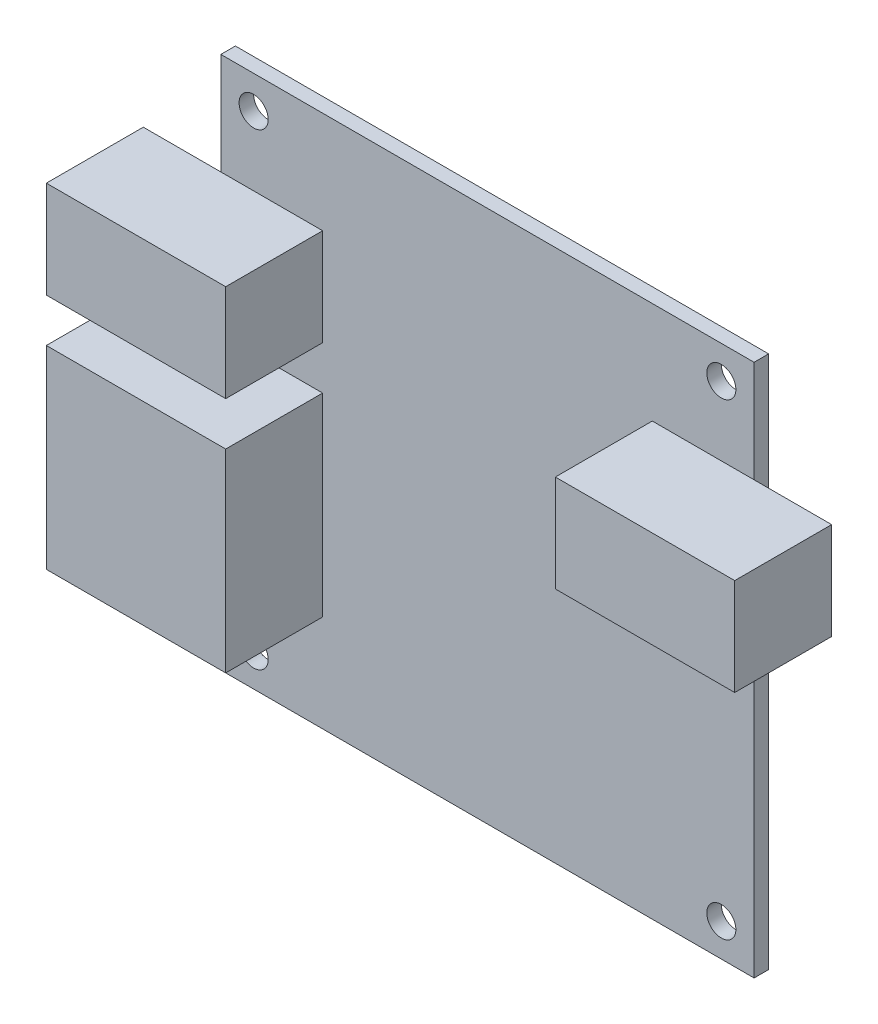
ISO-10303-21;
HEADER;
FILE_DESCRIPTION(('STEP AP214'),'2;1');
FILE_NAME('part.step','',(''),(''),'','','');
FILE_SCHEMA(('AUTOMOTIVE_DESIGN { 1 0 10303 214 1 1 1 1 }'));
ENDSEC;
DATA;
#1=APPLICATION_CONTEXT('core data for automotive mechanical design processes');
#2=APPLICATION_PROTOCOL_DEFINITION('international standard','automotive_design',2000,#1);
#3=PRODUCT_CONTEXT('',#1,'mechanical');
#4=PRODUCT('Part','Part','',(#3));
#5=PRODUCT_RELATED_PRODUCT_CATEGORY('part','',(#4));
#6=PRODUCT_DEFINITION_FORMATION('','',#4);
#7=PRODUCT_DEFINITION_CONTEXT('part definition',#1,'design');
#8=PRODUCT_DEFINITION('design','',#6,#7);
#9=PRODUCT_DEFINITION_SHAPE('','',#8);
#10=(LENGTH_UNIT() NAMED_UNIT(*) SI_UNIT(.MILLI.,.METRE.));
#11=(NAMED_UNIT(*) PLANE_ANGLE_UNIT() SI_UNIT($,.RADIAN.));
#12=(NAMED_UNIT(*) SI_UNIT($,.STERADIAN.) SOLID_ANGLE_UNIT());
#13=UNCERTAINTY_MEASURE_WITH_UNIT(LENGTH_MEASURE(1.E-05),#10,'distance_accuracy_value','');
#14=(GEOMETRIC_REPRESENTATION_CONTEXT(3) GLOBAL_UNCERTAINTY_ASSIGNED_CONTEXT((#13)) GLOBAL_UNIT_ASSIGNED_CONTEXT((#10,
#11,#12)) REPRESENTATION_CONTEXT('',''));
#15=CARTESIAN_POINT('',(0.,0.,0.));
#16=DIRECTION('',(0.,0.,1.));
#17=DIRECTION('',(1.,0.,0.));
#18=AXIS2_PLACEMENT_3D('',#15,#16,#17);
#19=CARTESIAN_POINT('',(0.,0.,1.5));
#20=DIRECTION('',(0.,0.,1.));
#21=DIRECTION('',(1.,0.,0.));
#22=AXIS2_PLACEMENT_3D('',#19,#20,#21);
#23=PLANE('',#22);
#24=CARTESIAN_POINT('',(24.12,24.12,1.5));
#25=DIRECTION('',(0.,0.,1.));
#26=DIRECTION('',(1.,0.,0.));
#27=AXIS2_PLACEMENT_3D('',#24,#25,#26);
#28=CIRCLE('',#27,1.5);
#29=CARTESIAN_POINT('',(25.62,24.12,1.5));
#30=VERTEX_POINT('',#29);
#31=EDGE_CURVE('E256',#30,#30,#28,.T.);
#32=ORIENTED_EDGE('',*,*,#31,.F.);
#33=EDGE_LOOP('',(#32));
#34=FACE_BOUND('',#33,.T.);
#35=CARTESIAN_POINT('',(24.12,-24.12,1.5));
#36=DIRECTION('',(0.,0.,1.));
#37=DIRECTION('',(1.,0.,0.));
#38=AXIS2_PLACEMENT_3D('',#35,#36,#37);
#39=CIRCLE('',#38,1.5);
#40=CARTESIAN_POINT('',(25.62,-24.12,1.5));
#41=VERTEX_POINT('',#40);
#42=EDGE_CURVE('E260',#41,#41,#39,.T.);
#43=ORIENTED_EDGE('',*,*,#42,.F.);
#44=EDGE_LOOP('',(#43));
#45=FACE_BOUND('',#44,.T.);
#46=CARTESIAN_POINT('',(-24.12,-24.12,1.5));
#47=DIRECTION('',(0.,0.,1.));
#48=DIRECTION('',(1.,0.,0.));
#49=AXIS2_PLACEMENT_3D('',#46,#47,#48);
#50=CIRCLE('',#49,1.5);
#51=CARTESIAN_POINT('',(-22.62,-24.12,1.5));
#52=VERTEX_POINT('',#51);
#53=EDGE_CURVE('E266',#52,#52,#50,.T.);
#54=ORIENTED_EDGE('',*,*,#53,.F.);
#55=EDGE_LOOP('',(#54));
#56=FACE_BOUND('',#55,.T.);
#57=CARTESIAN_POINT('',(-24.12,24.12,1.5));
#58=DIRECTION('',(0.,0.,1.));
#59=DIRECTION('',(1.,0.,0.));
#60=AXIS2_PLACEMENT_3D('',#57,#58,#59);
#61=CIRCLE('',#60,1.5);
#62=CARTESIAN_POINT('',(-22.62,24.12,1.5));
#63=VERTEX_POINT('',#62);
#64=EDGE_CURVE('E272',#63,#63,#61,.T.);
#65=ORIENTED_EDGE('',*,*,#64,.F.);
#66=EDGE_LOOP('',(#65));
#67=FACE_BOUND('',#66,.T.);
#68=DIRECTION('',(0.,1.,0.));
#69=VECTOR('',#68,1.);
#70=CARTESIAN_POINT('',(27.5,-27.5,1.5));
#71=LINE('',#70,#69);
#72=CARTESIAN_POINT('',(27.5,-27.5,1.5));
#73=VERTEX_POINT('',#72);
#74=CARTESIAN_POINT('',(27.5,7.00000000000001,1.5));
#75=VERTEX_POINT('',#74);
#76=EDGE_CURVE('E288',#73,#75,#71,.T.);
#77=ORIENTED_EDGE('',*,*,#76,.T.);
#78=DIRECTION('',(1.,0.,0.));
#79=VECTOR('',#78,1.);
#80=CARTESIAN_POINT('',(17.,7.00000000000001,1.5));
#81=LINE('',#80,#79);
#82=CARTESIAN_POINT('',(17.,7.00000000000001,1.5));
#83=VERTEX_POINT('',#82);
#84=EDGE_CURVE('E49',#83,#75,#81,.T.);
#85=ORIENTED_EDGE('',*,*,#84,.F.);
#86=DIRECTION('',(0.,-1.,0.));
#87=VECTOR('',#86,1.);
#88=CARTESIAN_POINT('',(17.,17.,1.5));
#89=LINE('',#88,#87);
#90=CARTESIAN_POINT('',(17.,17.,1.5));
#91=VERTEX_POINT('',#90);
#92=EDGE_CURVE('E54',#91,#83,#89,.T.);
#93=ORIENTED_EDGE('',*,*,#92,.F.);
#94=DIRECTION('',(-1.,0.,0.));
#95=VECTOR('',#94,1.);
#96=CARTESIAN_POINT('',(17.,17.,1.5));
#97=LINE('',#96,#95);
#98=CARTESIAN_POINT('',(27.5,17.,1.5));
#99=VERTEX_POINT('',#98);
#100=EDGE_CURVE('E371',#99,#91,#97,.T.);
#101=ORIENTED_EDGE('',*,*,#100,.F.);
#102=CARTESIAN_POINT('',(27.5,27.5,1.5));
#103=VERTEX_POINT('',#102);
#104=EDGE_CURVE('E287',#99,#103,#71,.T.);
#105=ORIENTED_EDGE('',*,*,#104,.T.);
#106=DIRECTION('',(-1.,0.,0.));
#107=VECTOR('',#106,1.);
#108=CARTESIAN_POINT('',(27.5,27.5,1.5));
#109=LINE('',#108,#107);
#110=CARTESIAN_POINT('',(-27.5,27.5,1.5));
#111=VERTEX_POINT('',#110);
#112=EDGE_CURVE('E290',#103,#111,#109,.T.);
#113=ORIENTED_EDGE('',*,*,#112,.T.);
#114=DIRECTION('',(0.,-1.,0.));
#115=VECTOR('',#114,1.);
#116=CARTESIAN_POINT('',(-27.5,-27.5,1.5));
#117=LINE('',#116,#115);
#118=CARTESIAN_POINT('',(-27.5,17.,1.5));
#119=VERTEX_POINT('',#118);
#120=EDGE_CURVE('E281',#111,#119,#117,.T.);
#121=ORIENTED_EDGE('',*,*,#120,.T.);
#122=DIRECTION('',(-1.,0.,0.));
#123=VECTOR('',#122,1.);
#124=CARTESIAN_POINT('',(-17.,17.,1.5));
#125=LINE('',#124,#123);
#126=CARTESIAN_POINT('',(-17.,17.,1.5));
#127=VERTEX_POINT('',#126);
#128=EDGE_CURVE('E238',#127,#119,#125,.T.);
#129=ORIENTED_EDGE('',*,*,#128,.F.);
#130=DIRECTION('',(0.,1.,0.));
#131=VECTOR('',#130,1.);
#132=CARTESIAN_POINT('',(-17.,17.,1.5));
#133=LINE('',#132,#131);
#134=CARTESIAN_POINT('',(-17.,7.00000000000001,1.5));
#135=VERTEX_POINT('',#134);
#136=EDGE_CURVE('E223',#135,#127,#133,.T.);
#137=ORIENTED_EDGE('',*,*,#136,.F.);
#138=DIRECTION('',(1.,0.,0.));
#139=VECTOR('',#138,1.);
#140=CARTESIAN_POINT('',(-17.,7.00000000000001,1.5));
#141=LINE('',#140,#139);
#142=CARTESIAN_POINT('',(-27.5,7.,1.5));
#143=VERTEX_POINT('',#142);
#144=EDGE_CURVE('E42',#143,#135,#141,.T.);
#145=ORIENTED_EDGE('',*,*,#144,.F.);
#146=CARTESIAN_POINT('',(-27.5,2.5,1.5));
#147=VERTEX_POINT('',#146);
#148=EDGE_CURVE('E340',#143,#147,#117,.T.);
#149=ORIENTED_EDGE('',*,*,#148,.T.);
#150=DIRECTION('',(-1.,0.,0.));
#151=VECTOR('',#150,1.);
#152=CARTESIAN_POINT('',(-17.,2.5,1.5));
#153=LINE('',#152,#151);
#154=CARTESIAN_POINT('',(-17.,2.5,1.5));
#155=VERTEX_POINT('',#154);
#156=EDGE_CURVE('E207',#155,#147,#153,.T.);
#157=ORIENTED_EDGE('',*,*,#156,.F.);
#158=DIRECTION('',(0.,1.,0.));
#159=VECTOR('',#158,1.);
#160=CARTESIAN_POINT('',(-17.,2.5,1.5));
#161=LINE('',#160,#159);
#162=CARTESIAN_POINT('',(-17.,-17.5,1.5));
#163=VERTEX_POINT('',#162);
#164=EDGE_CURVE('E187',#163,#155,#161,.T.);
#165=ORIENTED_EDGE('',*,*,#164,.F.);
#166=DIRECTION('',(-1.,0.,0.));
#167=VECTOR('',#166,1.);
#168=CARTESIAN_POINT('',(0.,-17.5,1.5));
#169=LINE('',#168,#167);
#170=CARTESIAN_POINT('',(-27.5,-17.5,1.5));
#171=VERTEX_POINT('',#170);
#172=EDGE_CURVE('E11',#163,#171,#169,.T.);
#173=ORIENTED_EDGE('',*,*,#172,.T.);
#174=CARTESIAN_POINT('',(-27.5,-27.5,1.5));
#175=VERTEX_POINT('',#174);
#176=EDGE_CURVE('E285',#171,#175,#117,.T.);
#177=ORIENTED_EDGE('',*,*,#176,.T.);
#178=DIRECTION('',(1.,0.,0.));
#179=VECTOR('',#178,1.);
#180=CARTESIAN_POINT('',(27.5,-27.5,1.5));
#181=LINE('',#180,#179);
#182=EDGE_CURVE('E283',#175,#73,#181,.T.);
#183=ORIENTED_EDGE('',*,*,#182,.T.);
#184=EDGE_LOOP('',(#77,#85,#93,#101,#105,#113,#121,#129,#137,#145,#149,#157,#165,#173,#177,#183));
#185=FACE_BOUND('',#184,.T.);
#186=ADVANCED_FACE('F34',(#34,#45,#56,#67,#185),#23,.T.);
#187=CARTESIAN_POINT('',(-27.5,-27.5,1.5));
#188=DIRECTION('',(1.,0.,0.));
#189=DIRECTION('',(0.,0.,-1.));
#190=AXIS2_PLACEMENT_3D('',#187,#188,#189);
#191=PLANE('',#190);
#192=DIRECTION('',(0.,-1.,0.));
#193=VECTOR('',#192,1.);
#194=CARTESIAN_POINT('',(-27.5,-27.5,0.));
#195=LINE('',#194,#193);
#196=CARTESIAN_POINT('',(-27.5,27.5,0.));
#197=VERTEX_POINT('',#196);
#198=CARTESIAN_POINT('',(-27.5,-27.5,0.));
#199=VERTEX_POINT('',#198);
#200=EDGE_CURVE('E278',#197,#199,#195,.T.);
#201=ORIENTED_EDGE('',*,*,#200,.T.);
#202=DIRECTION('',(0.,0.,-1.));
#203=VECTOR('',#202,1.);
#204=CARTESIAN_POINT('',(-27.5,-27.5,1.5));
#205=LINE('',#204,#203);
#206=EDGE_CURVE('E309',#175,#199,#205,.T.);
#207=ORIENTED_EDGE('',*,*,#206,.F.);
#208=ORIENTED_EDGE('',*,*,#176,.F.);
#209=EDGE_CURVE('E341',#147,#171,#117,.T.);
#210=ORIENTED_EDGE('',*,*,#209,.F.);
#211=ORIENTED_EDGE('',*,*,#148,.F.);
#212=EDGE_CURVE('E284',#119,#143,#117,.T.);
#213=ORIENTED_EDGE('',*,*,#212,.F.);
#214=ORIENTED_EDGE('',*,*,#120,.F.);
#215=DIRECTION('',(0.,0.,-1.));
#216=VECTOR('',#215,1.);
#217=CARTESIAN_POINT('',(-27.5,27.5,1.5));
#218=LINE('',#217,#216);
#219=EDGE_CURVE('E293',#111,#197,#218,.T.);
#220=ORIENTED_EDGE('',*,*,#219,.T.);
#221=EDGE_LOOP('',(#201,#207,#208,#210,#211,#213,#214,#220));
#222=FACE_BOUND('',#221,.T.);
#223=ADVANCED_FACE('F36',(#222),#191,.F.);
#224=CARTESIAN_POINT('',(27.5,-27.5,1.5));
#225=DIRECTION('',(0.,1.,0.));
#226=DIRECTION('',(-1.,0.,0.));
#227=AXIS2_PLACEMENT_3D('',#224,#225,#226);
#228=PLANE('',#227);
#229=DIRECTION('',(1.,0.,0.));
#230=VECTOR('',#229,1.);
#231=CARTESIAN_POINT('',(27.5,-27.5,0.));
#232=LINE('',#231,#230);
#233=CARTESIAN_POINT('',(27.5,-27.5,0.));
#234=VERTEX_POINT('',#233);
#235=EDGE_CURVE('E296',#199,#234,#232,.T.);
#236=ORIENTED_EDGE('',*,*,#235,.T.);
#237=DIRECTION('',(0.,0.,-1.));
#238=VECTOR('',#237,1.);
#239=CARTESIAN_POINT('',(27.5,-27.5,1.5));
#240=LINE('',#239,#238);
#241=EDGE_CURVE('E307',#73,#234,#240,.T.);
#242=ORIENTED_EDGE('',*,*,#241,.F.);
#243=ORIENTED_EDGE('',*,*,#182,.F.);
#244=ORIENTED_EDGE('',*,*,#206,.T.);
#245=EDGE_LOOP('',(#236,#242,#243,#244));
#246=FACE_BOUND('',#245,.T.);
#247=ADVANCED_FACE('F350',(#246),#228,.F.);
#248=CARTESIAN_POINT('',(27.5,-27.5,1.5));
#249=DIRECTION('',(-1.,0.,0.));
#250=DIRECTION('',(0.,0.,1.));
#251=AXIS2_PLACEMENT_3D('',#248,#249,#250);
#252=PLANE('',#251);
#253=DIRECTION('',(0.,1.,0.));
#254=VECTOR('',#253,1.);
#255=CARTESIAN_POINT('',(27.5,-27.5,0.));
#256=LINE('',#255,#254);
#257=CARTESIAN_POINT('',(27.5,27.5,0.));
#258=VERTEX_POINT('',#257);
#259=EDGE_CURVE('E298',#234,#258,#256,.T.);
#260=ORIENTED_EDGE('',*,*,#259,.T.);
#261=DIRECTION('',(0.,0.,-1.));
#262=VECTOR('',#261,1.);
#263=CARTESIAN_POINT('',(27.5,27.5,1.5));
#264=LINE('',#263,#262);
#265=EDGE_CURVE('E304',#103,#258,#264,.T.);
#266=ORIENTED_EDGE('',*,*,#265,.F.);
#267=ORIENTED_EDGE('',*,*,#104,.F.);
#268=EDGE_CURVE('E291',#75,#99,#71,.T.);
#269=ORIENTED_EDGE('',*,*,#268,.F.);
#270=ORIENTED_EDGE('',*,*,#76,.F.);
#271=ORIENTED_EDGE('',*,*,#241,.T.);
#272=EDGE_LOOP('',(#260,#266,#267,#269,#270,#271));
#273=FACE_BOUND('',#272,.T.);
#274=ADVANCED_FACE('F359',(#273),#252,.F.);
#275=CARTESIAN_POINT('',(27.5,27.5,1.5));
#276=DIRECTION('',(0.,-1.,0.));
#277=DIRECTION('',(1.,0.,0.));
#278=AXIS2_PLACEMENT_3D('',#275,#276,#277);
#279=PLANE('',#278);
#280=DIRECTION('',(-1.,0.,0.));
#281=VECTOR('',#280,1.);
#282=CARTESIAN_POINT('',(27.5,27.5,0.));
#283=LINE('',#282,#281);
#284=EDGE_CURVE('E300',#258,#197,#283,.T.);
#285=ORIENTED_EDGE('',*,*,#284,.T.);
#286=ORIENTED_EDGE('',*,*,#219,.F.);
#287=ORIENTED_EDGE('',*,*,#112,.F.);
#288=ORIENTED_EDGE('',*,*,#265,.T.);
#289=EDGE_LOOP('',(#285,#286,#287,#288));
#290=FACE_BOUND('',#289,.T.);
#291=ADVANCED_FACE('F407',(#290),#279,.F.);
#292=CARTESIAN_POINT('',(0.,0.,0.));
#293=DIRECTION('',(0.,0.,1.));
#294=DIRECTION('',(1.,0.,0.));
#295=AXIS2_PLACEMENT_3D('',#292,#293,#294);
#296=PLANE('',#295);
#297=CARTESIAN_POINT('',(24.12,24.12,0.));
#298=DIRECTION('',(0.,0.,1.));
#299=DIRECTION('',(1.,0.,0.));
#300=AXIS2_PLACEMENT_3D('',#297,#298,#299);
#301=CIRCLE('',#300,1.5);
#302=CARTESIAN_POINT('',(25.62,24.12,0.));
#303=VERTEX_POINT('',#302);
#304=EDGE_CURVE('E257',#303,#303,#301,.T.);
#305=ORIENTED_EDGE('',*,*,#304,.T.);
#306=EDGE_LOOP('',(#305));
#307=FACE_BOUND('',#306,.T.);
#308=CARTESIAN_POINT('',(24.12,-24.12,0.));
#309=DIRECTION('',(0.,0.,1.));
#310=DIRECTION('',(1.,0.,0.));
#311=AXIS2_PLACEMENT_3D('',#308,#309,#310);
#312=CIRCLE('',#311,1.5);
#313=CARTESIAN_POINT('',(25.62,-24.12,0.));
#314=VERTEX_POINT('',#313);
#315=EDGE_CURVE('E263',#314,#314,#312,.T.);
#316=ORIENTED_EDGE('',*,*,#315,.T.);
#317=EDGE_LOOP('',(#316));
#318=FACE_BOUND('',#317,.T.);
#319=CARTESIAN_POINT('',(-24.12,-24.12,0.));
#320=DIRECTION('',(0.,0.,1.));
#321=DIRECTION('',(1.,0.,0.));
#322=AXIS2_PLACEMENT_3D('',#319,#320,#321);
#323=CIRCLE('',#322,1.5);
#324=CARTESIAN_POINT('',(-22.62,-24.12,0.));
#325=VERTEX_POINT('',#324);
#326=EDGE_CURVE('E269',#325,#325,#323,.T.);
#327=ORIENTED_EDGE('',*,*,#326,.T.);
#328=EDGE_LOOP('',(#327));
#329=FACE_BOUND('',#328,.T.);
#330=CARTESIAN_POINT('',(-24.12,24.12,0.));
#331=DIRECTION('',(0.,0.,1.));
#332=DIRECTION('',(1.,0.,0.));
#333=AXIS2_PLACEMENT_3D('',#330,#331,#332);
#334=CIRCLE('',#333,1.5);
#335=CARTESIAN_POINT('',(-22.62,24.12,0.));
#336=VERTEX_POINT('',#335);
#337=EDGE_CURVE('E275',#336,#336,#334,.T.);
#338=ORIENTED_EDGE('',*,*,#337,.T.);
#339=EDGE_LOOP('',(#338));
#340=FACE_BOUND('',#339,.T.);
#341=ORIENTED_EDGE('',*,*,#200,.F.);
#342=ORIENTED_EDGE('',*,*,#284,.F.);
#343=ORIENTED_EDGE('',*,*,#259,.F.);
#344=ORIENTED_EDGE('',*,*,#235,.F.);
#345=EDGE_LOOP('',(#341,#342,#343,#344));
#346=FACE_BOUND('',#345,.T.);
#347=ADVANCED_FACE('F356',(#307,#318,#329,#340,#346),#296,.F.);
#348=CARTESIAN_POINT('',(-24.12,24.12,0.));
#349=DIRECTION('',(0.,0.,1.));
#350=DIRECTION('',(1.,0.,0.));
#351=AXIS2_PLACEMENT_3D('',#348,#349,#350);
#352=CYLINDRICAL_SURFACE('',#351,1.5);
#353=ORIENTED_EDGE('',*,*,#337,.F.);
#354=EDGE_LOOP('',(#353));
#355=FACE_BOUND('',#354,.T.);
#356=ORIENTED_EDGE('',*,*,#64,.T.);
#357=EDGE_LOOP('',(#356));
#358=FACE_BOUND('',#357,.T.);
#359=ADVANCED_FACE('F403',(#355,#358),#352,.F.);
#360=CARTESIAN_POINT('',(-24.12,-24.12,0.));
#361=DIRECTION('',(0.,0.,1.));
#362=DIRECTION('',(1.,0.,0.));
#363=AXIS2_PLACEMENT_3D('',#360,#361,#362);
#364=CYLINDRICAL_SURFACE('',#363,1.5);
#365=ORIENTED_EDGE('',*,*,#326,.F.);
#366=EDGE_LOOP('',(#365));
#367=FACE_BOUND('',#366,.T.);
#368=ORIENTED_EDGE('',*,*,#53,.T.);
#369=EDGE_LOOP('',(#368));
#370=FACE_BOUND('',#369,.T.);
#371=ADVANCED_FACE('F437',(#367,#370),#364,.F.);
#372=CARTESIAN_POINT('',(24.12,-24.12,0.));
#373=DIRECTION('',(0.,0.,1.));
#374=DIRECTION('',(1.,0.,0.));
#375=AXIS2_PLACEMENT_3D('',#372,#373,#374);
#376=CYLINDRICAL_SURFACE('',#375,1.5);
#377=ORIENTED_EDGE('',*,*,#315,.F.);
#378=EDGE_LOOP('',(#377));
#379=FACE_BOUND('',#378,.T.);
#380=ORIENTED_EDGE('',*,*,#42,.T.);
#381=EDGE_LOOP('',(#380));
#382=FACE_BOUND('',#381,.T.);
#383=ADVANCED_FACE('F444',(#379,#382),#376,.F.);
#384=CARTESIAN_POINT('',(24.12,24.12,0.));
#385=DIRECTION('',(0.,0.,1.));
#386=DIRECTION('',(1.,0.,0.));
#387=AXIS2_PLACEMENT_3D('',#384,#385,#386);
#388=CYLINDRICAL_SURFACE('',#387,1.5);
#389=ORIENTED_EDGE('',*,*,#304,.F.);
#390=EDGE_LOOP('',(#389));
#391=FACE_BOUND('',#390,.T.);
#392=ORIENTED_EDGE('',*,*,#31,.T.);
#393=EDGE_LOOP('',(#392));
#394=FACE_BOUND('',#393,.T.);
#395=ADVANCED_FACE('F451',(#391,#394),#388,.F.);
#396=CARTESIAN_POINT('',(-17.,17.,11.5));
#397=DIRECTION('',(-1.,0.,0.));
#398=DIRECTION('',(0.,0.,1.));
#399=AXIS2_PLACEMENT_3D('',#396,#397,#398);
#400=PLANE('',#399);
#401=ORIENTED_EDGE('',*,*,#136,.T.);
#402=DIRECTION('',(0.,0.,-1.));
#403=VECTOR('',#402,1.);
#404=CARTESIAN_POINT('',(-17.,17.,11.5));
#405=LINE('',#404,#403);
#406=CARTESIAN_POINT('',(-17.,17.,11.5));
#407=VERTEX_POINT('',#406);
#408=EDGE_CURVE('E253',#407,#127,#405,.T.);
#409=ORIENTED_EDGE('',*,*,#408,.F.);
#410=DIRECTION('',(0.,1.,0.));
#411=VECTOR('',#410,1.);
#412=CARTESIAN_POINT('',(-17.,17.,11.5));
#413=LINE('',#412,#411);
#414=CARTESIAN_POINT('',(-17.,7.00000000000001,11.5));
#415=VERTEX_POINT('',#414);
#416=EDGE_CURVE('E224',#415,#407,#413,.T.);
#417=ORIENTED_EDGE('',*,*,#416,.F.);
#418=DIRECTION('',(0.,0.,-1.));
#419=VECTOR('',#418,1.);
#420=CARTESIAN_POINT('',(-17.,7.00000000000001,11.5));
#421=LINE('',#420,#419);
#422=EDGE_CURVE('E234',#415,#135,#421,.T.);
#423=ORIENTED_EDGE('',*,*,#422,.T.);
#424=EDGE_LOOP('',(#401,#409,#417,#423));
#425=FACE_BOUND('',#424,.T.);
#426=ADVANCED_FACE('F324',(#425),#400,.F.);
#427=CARTESIAN_POINT('',(-17.,17.,11.5));
#428=DIRECTION('',(0.,-1.,0.));
#429=DIRECTION('',(1.,0.,0.));
#430=AXIS2_PLACEMENT_3D('',#427,#428,#429);
#431=PLANE('',#430);
#432=ORIENTED_EDGE('',*,*,#128,.T.);
#433=CARTESIAN_POINT('',(-35.5,17.,1.5));
#434=VERTEX_POINT('',#433);
#435=EDGE_CURVE('E237',#119,#434,#125,.T.);
#436=ORIENTED_EDGE('',*,*,#435,.T.);
#437=DIRECTION('',(0.,0.,-1.));
#438=VECTOR('',#437,1.);
#439=CARTESIAN_POINT('',(-35.5,17.,11.5));
#440=LINE('',#439,#438);
#441=CARTESIAN_POINT('',(-35.5,17.,11.5));
#442=VERTEX_POINT('',#441);
#443=EDGE_CURVE('E250',#442,#434,#440,.T.);
#444=ORIENTED_EDGE('',*,*,#443,.F.);
#445=DIRECTION('',(-1.,0.,0.));
#446=VECTOR('',#445,1.);
#447=CARTESIAN_POINT('',(-17.,17.,11.5));
#448=LINE('',#447,#446);
#449=EDGE_CURVE('E227',#407,#442,#448,.T.);
#450=ORIENTED_EDGE('',*,*,#449,.F.);
#451=ORIENTED_EDGE('',*,*,#408,.T.);
#452=EDGE_LOOP('',(#432,#436,#444,#450,#451));
#453=FACE_BOUND('',#452,.T.);
#454=ADVANCED_FACE('F466',(#453),#431,.F.);
#455=CARTESIAN_POINT('',(-35.5,17.,11.5));
#456=DIRECTION('',(1.,0.,0.));
#457=DIRECTION('',(0.,0.,-1.));
#458=AXIS2_PLACEMENT_3D('',#455,#456,#457);
#459=PLANE('',#458);
#460=DIRECTION('',(0.,-1.,0.));
#461=VECTOR('',#460,1.);
#462=CARTESIAN_POINT('',(-35.5,17.,1.5));
#463=LINE('',#462,#461);
#464=CARTESIAN_POINT('',(-35.5,7.,1.5));
#465=VERTEX_POINT('',#464);
#466=EDGE_CURVE('E241',#434,#465,#463,.T.);
#467=ORIENTED_EDGE('',*,*,#466,.T.);
#468=DIRECTION('',(0.,0.,-1.));
#469=VECTOR('',#468,1.);
#470=CARTESIAN_POINT('',(-35.5,7.,11.5));
#471=LINE('',#470,#469);
#472=CARTESIAN_POINT('',(-35.5,7.,11.5));
#473=VERTEX_POINT('',#472);
#474=EDGE_CURVE('E247',#473,#465,#471,.T.);
#475=ORIENTED_EDGE('',*,*,#474,.F.);
#476=DIRECTION('',(0.,-1.,0.));
#477=VECTOR('',#476,1.);
#478=CARTESIAN_POINT('',(-35.5,17.,11.5));
#479=LINE('',#478,#477);
#480=EDGE_CURVE('E230',#442,#473,#479,.T.);
#481=ORIENTED_EDGE('',*,*,#480,.F.);
#482=ORIENTED_EDGE('',*,*,#443,.T.);
#483=EDGE_LOOP('',(#467,#475,#481,#482));
#484=FACE_BOUND('',#483,.T.);
#485=ADVANCED_FACE('F474',(#484),#459,.F.);
#486=CARTESIAN_POINT('',(-17.,7.00000000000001,11.5));
#487=DIRECTION('',(0.,1.,0.));
#488=DIRECTION('',(-1.,0.,0.));
#489=AXIS2_PLACEMENT_3D('',#486,#487,#488);
#490=PLANE('',#489);
#491=EDGE_CURVE('E228',#465,#143,#141,.T.);
#492=ORIENTED_EDGE('',*,*,#491,.T.);
#493=ORIENTED_EDGE('',*,*,#144,.T.);
#494=ORIENTED_EDGE('',*,*,#422,.F.);
#495=DIRECTION('',(1.,0.,0.));
#496=VECTOR('',#495,1.);
#497=CARTESIAN_POINT('',(-17.,7.00000000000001,11.5));
#498=LINE('',#497,#496);
#499=EDGE_CURVE('E232',#473,#415,#498,.T.);
#500=ORIENTED_EDGE('',*,*,#499,.F.);
#501=ORIENTED_EDGE('',*,*,#474,.T.);
#502=EDGE_LOOP('',(#492,#493,#494,#500,#501));
#503=FACE_BOUND('',#502,.T.);
#504=ADVANCED_FACE('F317',(#503),#490,.F.);
#505=CARTESIAN_POINT('',(0.,0.,11.5));
#506=DIRECTION('',(0.,0.,-1.));
#507=DIRECTION('',(-1.,0.,0.));
#508=AXIS2_PLACEMENT_3D('',#505,#506,#507);
#509=PLANE('',#508);
#510=ORIENTED_EDGE('',*,*,#416,.T.);
#511=ORIENTED_EDGE('',*,*,#449,.T.);
#512=ORIENTED_EDGE('',*,*,#480,.T.);
#513=ORIENTED_EDGE('',*,*,#499,.T.);
#514=EDGE_LOOP('',(#510,#511,#512,#513));
#515=FACE_BOUND('',#514,.T.);
#516=ADVANCED_FACE('F327',(#515),#509,.F.);
#517=CARTESIAN_POINT('',(0.,0.,1.5));
#518=DIRECTION('',(0.,0.,-1.));
#519=DIRECTION('',(-1.,0.,0.));
#520=AXIS2_PLACEMENT_3D('',#517,#518,#519);
#521=PLANE('',#520);
#522=ORIENTED_EDGE('',*,*,#435,.F.);
#523=ORIENTED_EDGE('',*,*,#212,.T.);
#524=ORIENTED_EDGE('',*,*,#491,.F.);
#525=ORIENTED_EDGE('',*,*,#466,.F.);
#526=EDGE_LOOP('',(#522,#523,#524,#525));
#527=FACE_BOUND('',#526,.T.);
#528=ADVANCED_FACE('F336',(#527),#521,.T.);
#529=CARTESIAN_POINT('',(0.,0.,1.5));
#530=DIRECTION('',(0.,0.,-1.));
#531=DIRECTION('',(-1.,0.,0.));
#532=AXIS2_PLACEMENT_3D('',#529,#530,#531);
#533=PLANE('',#532);
#534=ORIENTED_EDGE('',*,*,#209,.T.);
#535=DIRECTION('',(1.,0.,0.));
#536=VECTOR('',#535,1.);
#537=CARTESIAN_POINT('',(-17.,-17.5,1.5));
#538=LINE('',#537,#536);
#539=CARTESIAN_POINT('',(-35.5,-17.5,1.5));
#540=VERTEX_POINT('',#539);
#541=EDGE_CURVE('E200',#540,#171,#538,.T.);
#542=ORIENTED_EDGE('',*,*,#541,.F.);
#543=DIRECTION('',(0.,-1.,0.));
#544=VECTOR('',#543,1.);
#545=CARTESIAN_POINT('',(-35.5,2.5,1.5));
#546=LINE('',#545,#544);
#547=CARTESIAN_POINT('',(-35.5,2.5,1.5));
#548=VERTEX_POINT('',#547);
#549=EDGE_CURVE('E210',#548,#540,#546,.T.);
#550=ORIENTED_EDGE('',*,*,#549,.F.);
#551=EDGE_CURVE('E190',#147,#548,#153,.T.);
#552=ORIENTED_EDGE('',*,*,#551,.F.);
#553=EDGE_LOOP('',(#534,#542,#550,#552));
#554=FACE_BOUND('',#553,.T.);
#555=ADVANCED_FACE('F502',(#554),#533,.T.);
#556=CARTESIAN_POINT('',(-17.,2.5,11.5));
#557=DIRECTION('',(-1.,0.,0.));
#558=DIRECTION('',(0.,-1.,0.));
#559=AXIS2_PLACEMENT_3D('',#556,#557,#558);
#560=PLANE('',#559);
#561=ORIENTED_EDGE('',*,*,#164,.T.);
#562=DIRECTION('',(0.,0.,-1.));
#563=VECTOR('',#562,1.);
#564=CARTESIAN_POINT('',(-17.,2.5,11.5));
#565=LINE('',#564,#563);
#566=CARTESIAN_POINT('',(-17.,2.5,11.5));
#567=VERTEX_POINT('',#566);
#568=EDGE_CURVE('E221',#567,#155,#565,.T.);
#569=ORIENTED_EDGE('',*,*,#568,.F.);
#570=DIRECTION('',(0.,1.,0.));
#571=VECTOR('',#570,1.);
#572=CARTESIAN_POINT('',(-17.,2.5,11.5));
#573=LINE('',#572,#571);
#574=CARTESIAN_POINT('',(-17.,-17.5,11.5));
#575=VERTEX_POINT('',#574);
#576=EDGE_CURVE('E196',#575,#567,#573,.T.);
#577=ORIENTED_EDGE('',*,*,#576,.F.);
#578=DIRECTION('',(0.,0.,-1.));
#579=VECTOR('',#578,1.);
#580=CARTESIAN_POINT('',(-17.,-17.5,11.5));
#581=LINE('',#580,#579);
#582=EDGE_CURVE('E205',#575,#163,#581,.T.);
#583=ORIENTED_EDGE('',*,*,#582,.T.);
#584=EDGE_LOOP('',(#561,#569,#577,#583));
#585=FACE_BOUND('',#584,.T.);
#586=ADVANCED_FACE('F509',(#585),#560,.F.);
#587=CARTESIAN_POINT('',(-17.,2.5,11.5));
#588=DIRECTION('',(0.,-1.,0.));
#589=DIRECTION('',(1.,0.,0.));
#590=AXIS2_PLACEMENT_3D('',#587,#588,#589);
#591=PLANE('',#590);
#592=ORIENTED_EDGE('',*,*,#156,.T.);
#593=ORIENTED_EDGE('',*,*,#551,.T.);
#594=DIRECTION('',(0.,0.,-1.));
#595=VECTOR('',#594,1.);
#596=CARTESIAN_POINT('',(-35.5,2.5,11.5));
#597=LINE('',#596,#595);
#598=CARTESIAN_POINT('',(-35.5,2.5,11.5));
#599=VERTEX_POINT('',#598);
#600=EDGE_CURVE('E218',#599,#548,#597,.T.);
#601=ORIENTED_EDGE('',*,*,#600,.F.);
#602=DIRECTION('',(-1.,0.,0.));
#603=VECTOR('',#602,1.);
#604=CARTESIAN_POINT('',(-17.,2.5,11.5));
#605=LINE('',#604,#603);
#606=EDGE_CURVE('E199',#567,#599,#605,.T.);
#607=ORIENTED_EDGE('',*,*,#606,.F.);
#608=ORIENTED_EDGE('',*,*,#568,.T.);
#609=EDGE_LOOP('',(#592,#593,#601,#607,#608));
#610=FACE_BOUND('',#609,.T.);
#611=ADVANCED_FACE('F517',(#610),#591,.F.);
#612=CARTESIAN_POINT('',(-35.5,2.5,11.5));
#613=DIRECTION('',(1.,0.,0.));
#614=DIRECTION('',(0.,0.,-1.));
#615=AXIS2_PLACEMENT_3D('',#612,#613,#614);
#616=PLANE('',#615);
#617=ORIENTED_EDGE('',*,*,#549,.T.);
#618=DIRECTION('',(0.,0.,-1.));
#619=VECTOR('',#618,1.);
#620=CARTESIAN_POINT('',(-35.5,-17.5,11.5));
#621=LINE('',#620,#619);
#622=CARTESIAN_POINT('',(-35.5,-17.5,11.5));
#623=VERTEX_POINT('',#622);
#624=EDGE_CURVE('E215',#623,#540,#621,.T.);
#625=ORIENTED_EDGE('',*,*,#624,.F.);
#626=DIRECTION('',(0.,-1.,0.));
#627=VECTOR('',#626,1.);
#628=CARTESIAN_POINT('',(-35.5,2.5,11.5));
#629=LINE('',#628,#627);
#630=EDGE_CURVE('E202',#599,#623,#629,.T.);
#631=ORIENTED_EDGE('',*,*,#630,.F.);
#632=ORIENTED_EDGE('',*,*,#600,.T.);
#633=EDGE_LOOP('',(#617,#625,#631,#632));
#634=FACE_BOUND('',#633,.T.);
#635=ADVANCED_FACE('F525',(#634),#616,.F.);
#636=CARTESIAN_POINT('',(-17.,-17.5,11.5));
#637=DIRECTION('',(0.,1.,0.));
#638=DIRECTION('',(-1.,0.,0.));
#639=AXIS2_PLACEMENT_3D('',#636,#637,#638);
#640=PLANE('',#639);
#641=ORIENTED_EDGE('',*,*,#541,.T.);
#642=ORIENTED_EDGE('',*,*,#172,.F.);
#643=ORIENTED_EDGE('',*,*,#582,.F.);
#644=DIRECTION('',(1.,0.,0.));
#645=VECTOR('',#644,1.);
#646=CARTESIAN_POINT('',(-17.,-17.5,11.5));
#647=LINE('',#646,#645);
#648=EDGE_CURVE('E204',#623,#575,#647,.T.);
#649=ORIENTED_EDGE('',*,*,#648,.F.);
#650=ORIENTED_EDGE('',*,*,#624,.T.);
#651=EDGE_LOOP('',(#641,#642,#643,#649,#650));
#652=FACE_BOUND('',#651,.T.);
#653=ADVANCED_FACE('F533',(#652),#640,.F.);
#654=CARTESIAN_POINT('',(0.,0.,11.5));
#655=DIRECTION('',(0.,0.,-1.));
#656=DIRECTION('',(-1.,0.,0.));
#657=AXIS2_PLACEMENT_3D('',#654,#655,#656);
#658=PLANE('',#657);
#659=ORIENTED_EDGE('',*,*,#576,.T.);
#660=ORIENTED_EDGE('',*,*,#606,.T.);
#661=ORIENTED_EDGE('',*,*,#630,.T.);
#662=ORIENTED_EDGE('',*,*,#648,.T.);
#663=EDGE_LOOP('',(#659,#660,#661,#662));
#664=FACE_BOUND('',#663,.T.);
#665=ADVANCED_FACE('F540',(#664),#658,.F.);
#666=CARTESIAN_POINT('',(0.,0.,1.5));
#667=DIRECTION('',(0.,0.,1.));
#668=DIRECTION('',(1.,0.,0.));
#669=AXIS2_PLACEMENT_3D('',#666,#667,#668);
#670=PLANE('',#669);
#671=CARTESIAN_POINT('',(35.5,7.00000000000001,1.5));
#672=VERTEX_POINT('',#671);
#673=EDGE_CURVE('E365',#75,#672,#81,.T.);
#674=ORIENTED_EDGE('',*,*,#673,.F.);
#675=ORIENTED_EDGE('',*,*,#268,.T.);
#676=CARTESIAN_POINT('',(35.5,17.,1.5));
#677=VERTEX_POINT('',#676);
#678=EDGE_CURVE('E184',#677,#99,#97,.T.);
#679=ORIENTED_EDGE('',*,*,#678,.F.);
#680=DIRECTION('',(0.,1.,0.));
#681=VECTOR('',#680,1.);
#682=CARTESIAN_POINT('',(35.5,17.,1.5));
#683=LINE('',#682,#681);
#684=EDGE_CURVE('E369',#672,#677,#683,.T.);
#685=ORIENTED_EDGE('',*,*,#684,.F.);
#686=EDGE_LOOP('',(#674,#675,#679,#685));
#687=FACE_BOUND('',#686,.T.);
#688=ADVANCED_FACE('F366',(#687),#670,.F.);
#689=CARTESIAN_POINT('',(17.,17.,11.5));
#690=DIRECTION('',(1.,0.,0.));
#691=DIRECTION('',(0.,1.,0.));
#692=AXIS2_PLACEMENT_3D('',#689,#690,#691);
#693=PLANE('',#692);
#694=ORIENTED_EDGE('',*,*,#92,.T.);
#695=DIRECTION('',(0.,0.,-1.));
#696=VECTOR('',#695,1.);
#697=CARTESIAN_POINT('',(17.,7.00000000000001,11.5));
#698=LINE('',#697,#696);
#699=CARTESIAN_POINT('',(17.,7.00000000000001,11.5));
#700=VERTEX_POINT('',#699);
#701=EDGE_CURVE('E169',#700,#83,#698,.T.);
#702=ORIENTED_EDGE('',*,*,#701,.F.);
#703=DIRECTION('',(0.,-1.,0.));
#704=VECTOR('',#703,1.);
#705=CARTESIAN_POINT('',(17.,17.,11.5));
#706=LINE('',#705,#704);
#707=CARTESIAN_POINT('',(17.,17.,11.5));
#708=VERTEX_POINT('',#707);
#709=EDGE_CURVE('E175',#708,#700,#706,.T.);
#710=ORIENTED_EDGE('',*,*,#709,.F.);
#711=DIRECTION('',(0.,0.,-1.));
#712=VECTOR('',#711,1.);
#713=CARTESIAN_POINT('',(17.,17.,11.5));
#714=LINE('',#713,#712);
#715=EDGE_CURVE('E377',#708,#91,#714,.T.);
#716=ORIENTED_EDGE('',*,*,#715,.T.);
#717=EDGE_LOOP('',(#694,#702,#710,#716));
#718=FACE_BOUND('',#717,.T.);
#719=ADVANCED_FACE('F186',(#718),#693,.F.);
#720=CARTESIAN_POINT('',(17.,7.00000000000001,11.5));
#721=DIRECTION('',(0.,1.,0.));
#722=DIRECTION('',(0.,0.,1.));
#723=AXIS2_PLACEMENT_3D('',#720,#721,#722);
#724=PLANE('',#723);
#725=ORIENTED_EDGE('',*,*,#84,.T.);
#726=ORIENTED_EDGE('',*,*,#673,.T.);
#727=DIRECTION('',(0.,0.,-1.));
#728=VECTOR('',#727,1.);
#729=CARTESIAN_POINT('',(35.5,7.00000000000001,11.5));
#730=LINE('',#729,#728);
#731=CARTESIAN_POINT('',(35.5,7.00000000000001,11.5));
#732=VERTEX_POINT('',#731);
#733=EDGE_CURVE('E171',#732,#672,#730,.T.);
#734=ORIENTED_EDGE('',*,*,#733,.F.);
#735=DIRECTION('',(1.,0.,0.));
#736=VECTOR('',#735,1.);
#737=CARTESIAN_POINT('',(17.,7.00000000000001,11.5));
#738=LINE('',#737,#736);
#739=EDGE_CURVE('E165',#700,#732,#738,.T.);
#740=ORIENTED_EDGE('',*,*,#739,.F.);
#741=ORIENTED_EDGE('',*,*,#701,.T.);
#742=EDGE_LOOP('',(#725,#726,#734,#740,#741));
#743=FACE_BOUND('',#742,.T.);
#744=ADVANCED_FACE('F167',(#743),#724,.F.);
#745=CARTESIAN_POINT('',(35.5,17.,11.5));
#746=DIRECTION('',(-1.,0.,0.));
#747=DIRECTION('',(0.,-1.,0.));
#748=AXIS2_PLACEMENT_3D('',#745,#746,#747);
#749=PLANE('',#748);
#750=ORIENTED_EDGE('',*,*,#684,.T.);
#751=DIRECTION('',(0.,0.,-1.));
#752=VECTOR('',#751,1.);
#753=CARTESIAN_POINT('',(35.5,17.,11.5));
#754=LINE('',#753,#752);
#755=CARTESIAN_POINT('',(35.5,17.,11.5));
#756=VERTEX_POINT('',#755);
#757=EDGE_CURVE('E192',#756,#677,#754,.T.);
#758=ORIENTED_EDGE('',*,*,#757,.F.);
#759=DIRECTION('',(0.,1.,0.));
#760=VECTOR('',#759,1.);
#761=CARTESIAN_POINT('',(35.5,17.,11.5));
#762=LINE('',#761,#760);
#763=EDGE_CURVE('E174',#732,#756,#762,.T.);
#764=ORIENTED_EDGE('',*,*,#763,.F.);
#765=ORIENTED_EDGE('',*,*,#733,.T.);
#766=EDGE_LOOP('',(#750,#758,#764,#765));
#767=FACE_BOUND('',#766,.T.);
#768=ADVANCED_FACE('F383',(#767),#749,.F.);
#769=CARTESIAN_POINT('',(17.,17.,11.5));
#770=DIRECTION('',(0.,-1.,0.));
#771=DIRECTION('',(0.,0.,-1.));
#772=AXIS2_PLACEMENT_3D('',#769,#770,#771);
#773=PLANE('',#772);
#774=ORIENTED_EDGE('',*,*,#678,.T.);
#775=ORIENTED_EDGE('',*,*,#100,.T.);
#776=ORIENTED_EDGE('',*,*,#715,.F.);
#777=DIRECTION('',(-1.,0.,0.));
#778=VECTOR('',#777,1.);
#779=CARTESIAN_POINT('',(17.,17.,11.5));
#780=LINE('',#779,#778);
#781=EDGE_CURVE('E180',#756,#708,#780,.T.);
#782=ORIENTED_EDGE('',*,*,#781,.F.);
#783=ORIENTED_EDGE('',*,*,#757,.T.);
#784=EDGE_LOOP('',(#774,#775,#776,#782,#783));
#785=FACE_BOUND('',#784,.T.);
#786=ADVANCED_FACE('F381',(#785),#773,.F.);
#787=CARTESIAN_POINT('',(0.,0.,11.5));
#788=DIRECTION('',(0.,0.,1.));
#789=DIRECTION('',(1.,0.,0.));
#790=AXIS2_PLACEMENT_3D('',#787,#788,#789);
#791=PLANE('',#790);
#792=ORIENTED_EDGE('',*,*,#709,.T.);
#793=ORIENTED_EDGE('',*,*,#739,.T.);
#794=ORIENTED_EDGE('',*,*,#763,.T.);
#795=ORIENTED_EDGE('',*,*,#781,.T.);
#796=EDGE_LOOP('',(#792,#793,#794,#795));
#797=FACE_BOUND('',#796,.T.);
#798=ADVANCED_FACE('F178',(#797),#791,.T.);
#799=CLOSED_SHELL('',(#186,#223,#247,#274,#291,#347,#359,#371,#383,#395,#426,#454,#485,#504,
#516,#528,#555,#586,#611,#635,#653,#665,#688,#719,#744,#768,#786,#798));
#800=MANIFOLD_SOLID_BREP('B2',#799);
#801=ADVANCED_BREP_SHAPE_REPRESENTATION('',(#18,#800),#14);
#802=SHAPE_DEFINITION_REPRESENTATION(#9,#801);
ENDSEC;
END-ISO-10303-21;
